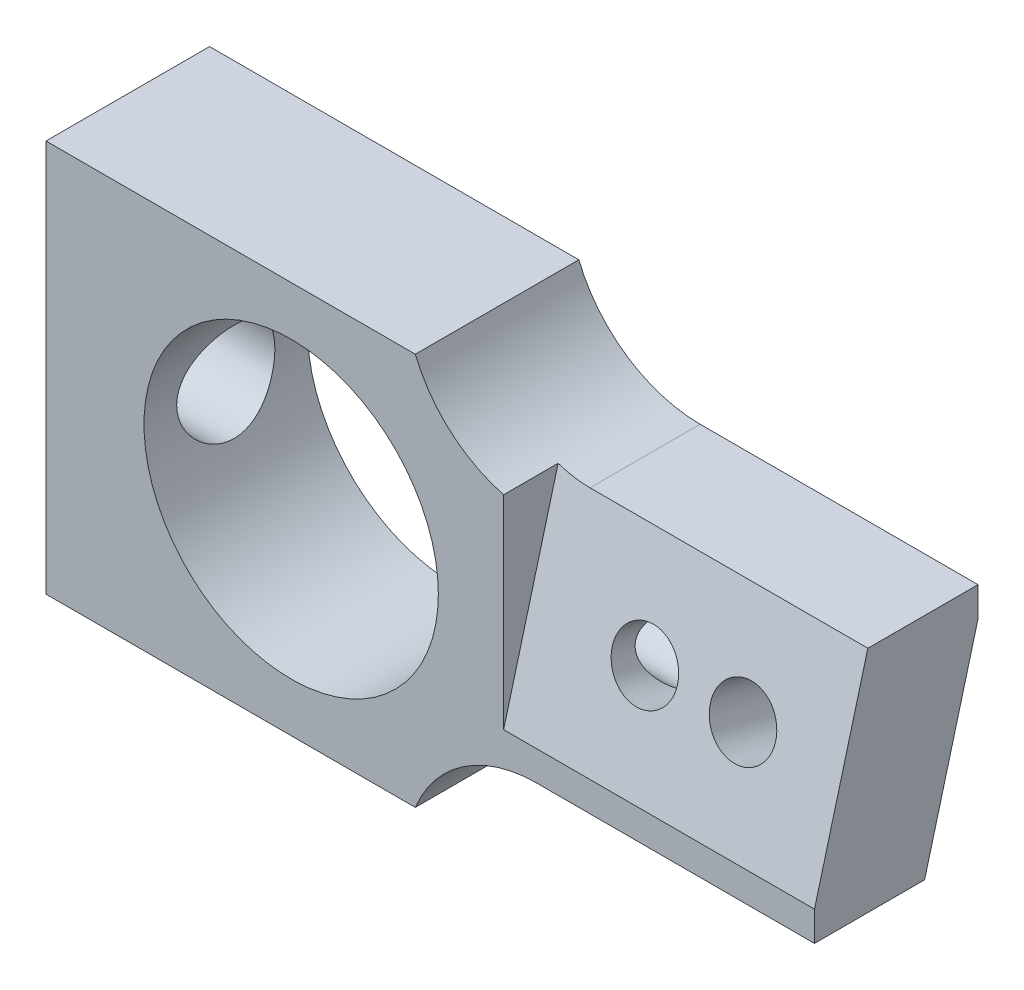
from build123d import *

# Parameters (mm, degrees)
SKETCH2_R           = 14.287500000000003
BOSS_EXTRUDE1_DEPTH = 7.9375
SKETCH4_R           = 4.7625
CUT_EXTRUDE1_DEPTH  = 50.8
SKETCH5_R           = 3.175
CUT_EXTRUDE2_DEPTH  = 31.75
CUT_EXTRUDE3_START  = 20.6248
CUT_EXTRUDE3_DEPTH  = 43.18
SKETCH8_R           = 3.175000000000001
SKETCH8_R_2         = 3.1749999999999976
CUT_EXTRUDE4_DEPTH  = 25.4


with BuildPart() as part:
    # Sketch2 → Boss-Extrude1 (new, symmetric)
    with BuildSketch(Plane.XY):
        with BuildLine():
            Line((-23.7998, -19.05), (12.051984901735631, -19.050000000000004))
            ThreePointArc((12.051984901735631, -19.050000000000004), (16.72568417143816, -13.282216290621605), (23.8252, -11.112499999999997))
            Line((23.8252, -11.112499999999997), (50.8, -11.1125))
            Line((50.8, -11.1125), (50.8, 11.1125))
            Line((50.8, 11.1125), (23.825200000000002, 11.112499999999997))
            ThreePointArc((23.825200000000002, 11.112499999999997), (16.725684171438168, 13.282216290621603), (12.051984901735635, 19.049999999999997))
            Line((12.051984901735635, 19.049999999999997), (-23.7998, 19.05))
            Line((-23.7998, 19.05), (-23.7998, -19.05))
        make_face()
        Circle(SKETCH2_R, mode=Mode.SUBTRACT)
    extrude(amount=BOSS_EXTRUDE1_DEPTH, both=True)

    # Sketch4 → Cut-Extrude1 (cut)
    with BuildSketch(Plane(origin=(0, 0, 0), x_dir=(0, 0, -1), z_dir=(1, 0, 0))):
        Circle(SKETCH4_R)
    extrude(amount=-CUT_EXTRUDE1_DEPTH, mode=Mode.SUBTRACT)

    # Sketch5 → Cut-Extrude2 (cut)
    with BuildSketch(Plane(origin=(0, 0, 0), x_dir=(0, 0, -1), z_dir=(1, 0, 0))):
        Circle(SKETCH5_R)
    extrude(amount=CUT_EXTRUDE2_DEPTH, mode=Mode.SUBTRACT)

    # Sketch7 → Cut-Extrude3 (cut)
    with BuildSketch(Plane(origin=(0, 0, 0), x_dir=(0, 0, -1), z_dir=(1, 0, 0)).offset(CUT_EXTRUDE3_START)):
        Polygon((9.812803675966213, 15.227783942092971), (0.2878036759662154, -20.32), (9.812803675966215, -20.32), align=None)
        Polygon((-9.812803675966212, -15.227783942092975), (-0.2878036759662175, 20.32), (-9.812803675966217, 20.320000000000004), align=None)
    extrude(amount=CUT_EXTRUDE3_DEPTH, mode=Mode.SUBTRACT)

    # Sketch8 → Cut-Extrude4 (cut)
    with BuildSketch(Plane(origin=(0, -1.4331328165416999, -5.348524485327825), x_dir=(-1, 0, 0), z_dir=(0, -0.25881904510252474, -0.9659258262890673))):
        with Locations(Location((-31.75, 0, 0), (0, 0, 90))):
            Circle(SKETCH8_R)
        with Locations(Location((-41.275, 0, 0), (0, 0, 90))):
            Circle(SKETCH8_R_2)
    extrude(amount=-CUT_EXTRUDE4_DEPTH, mode=Mode.SUBTRACT)


solid = part.part
